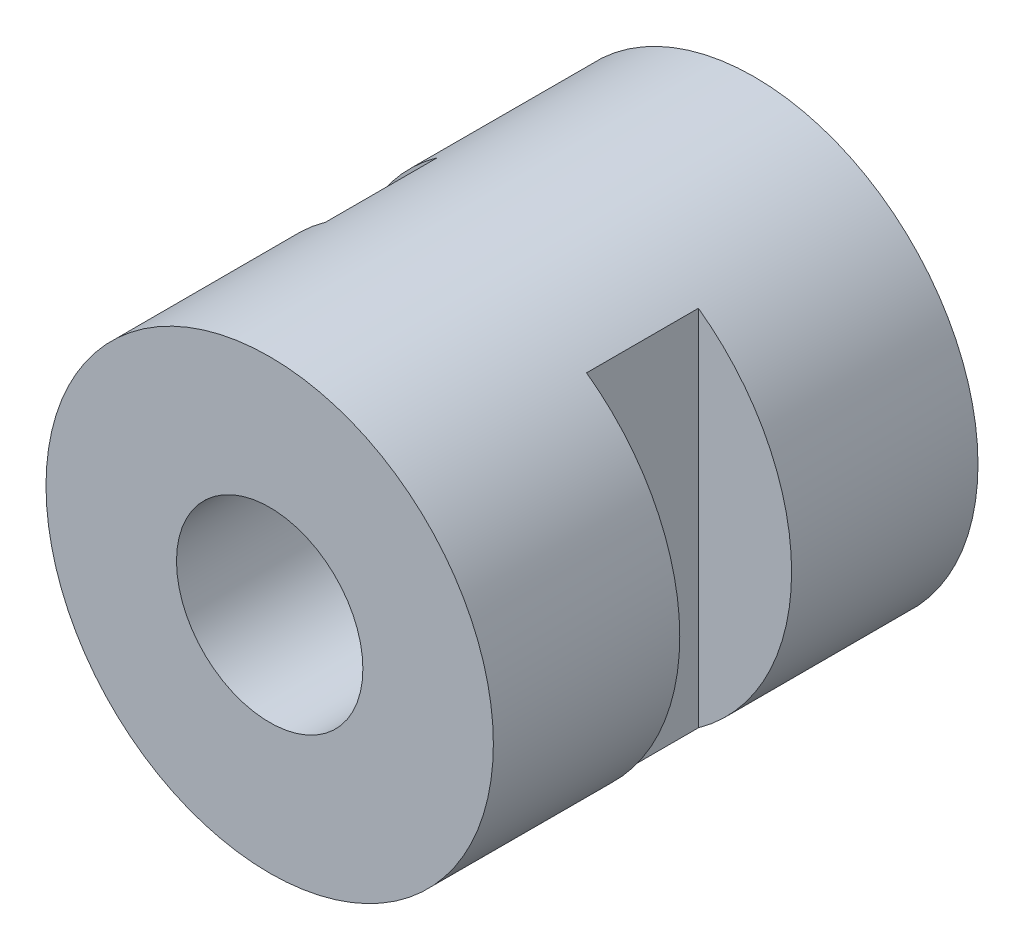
from build123d import *

# Parameters (mm, degrees)
SKETCH_1_R          = 6
EXTRUDE_1_DEPTH     = 13
SKETCH_2_W          = 3.141046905
SKETCH_2_H          = 3
CUT_EXTRUDE_1_DEPTH = 20.678668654
SKETCH_3_R          = 2.5
CUT_EXTRUDE_2_DEPTH = 13


with BuildPart() as part:
    # Sketch 1 → Extrude 1 (new body)
    with BuildSketch(Plane.XY):
        with Locations(Location((0, 0, 0), (0, 0, 180))):
            Circle(SKETCH_1_R)
    extrude(amount=EXTRUDE_1_DEPTH)

    # Sketch 2 → Cut-Extrude 1 (cut, through all)
    with BuildSketch(Plane(origin=(0, 7.5, 0), x_dir=(-1, 0, 0), z_dir=(0, 1, 0))):
        with Locations((-5.070523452, 6.5)):
            Rectangle(SKETCH_2_W, SKETCH_2_H)
        with Locations((5.070523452, 6.5)):
            Rectangle(SKETCH_2_W, SKETCH_2_H)
    extrude(amount=-CUT_EXTRUDE_1_DEPTH, mode=Mode.SUBTRACT)

    # Sketch 3 → Cut-Extrude 2 (cut)
    with BuildSketch(Plane.XY.offset(13)):
        Circle(SKETCH_3_R)
    extrude(amount=-CUT_EXTRUDE_2_DEPTH, mode=Mode.SUBTRACT)


solid = part.part
